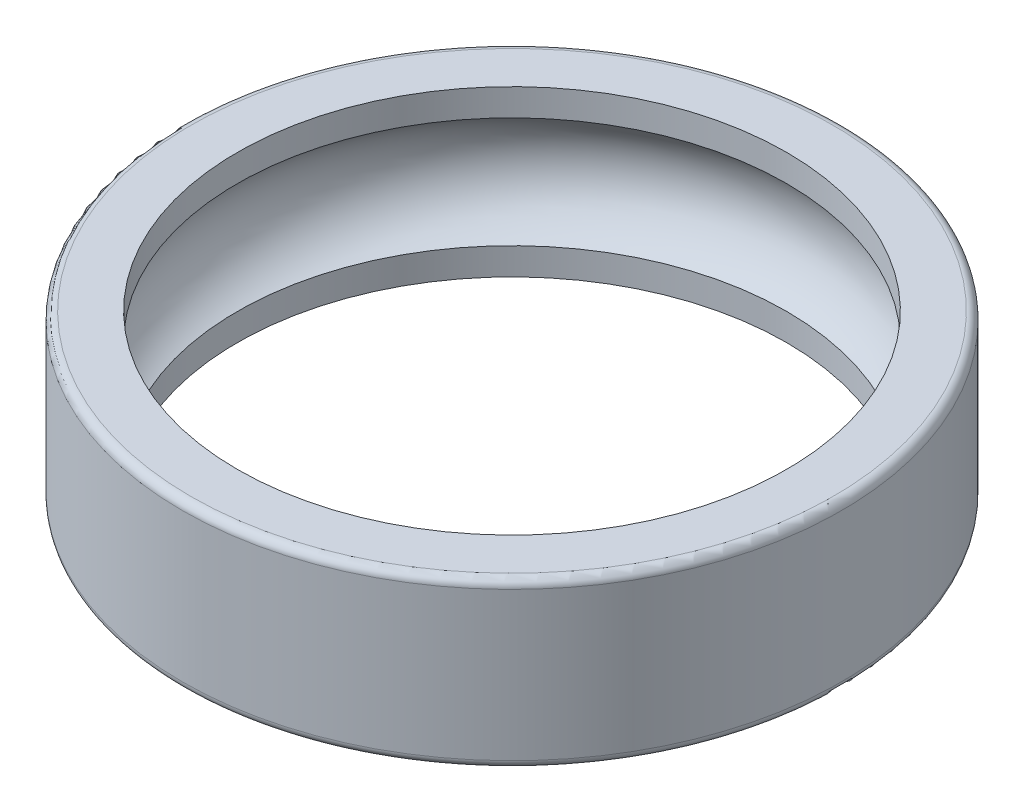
from build123d import *

# Parameters (mm, degrees)
CONG_1_R = 0.3


with BuildPart() as part:
    # Esquisse1 → R_volution1 (revolve)
    with BuildSketch(Plane(origin=(0, 0, 0), x_dir=(-1, 0, 0), z_dir=(0, 0, -1)), mode=Mode.PRIVATE) as r_volution1_sk:
        with BuildLine():
            Line((-10, -3), (-10, -2.015564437))
            ThreePointArc((-10, -2.015564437), (-11.25, 0), (-10, 2.015564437))
            Line((-10, 2.015564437), (-10, 3))
            Line((-10, 3), (-12, 3))
            Line((-12, 3), (-12, -3))
            Line((-12, -3), (-10, -3))
        make_face()
    revolve(r_volution1_sk.sketch.rotate(Axis((0, -3, 0), (0, 1, 0)), 270), axis=Axis((0, -3, 0), (0, 1, 0)))

    # Cong_1
    cong_1_edges = [part.edges().sort_by_distance(p)[0] for p in [
        (0, 3, -12),
        (0, -3, -12),
    ]]
    fillet(cong_1_edges, radius=CONG_1_R)


solid = part.part
